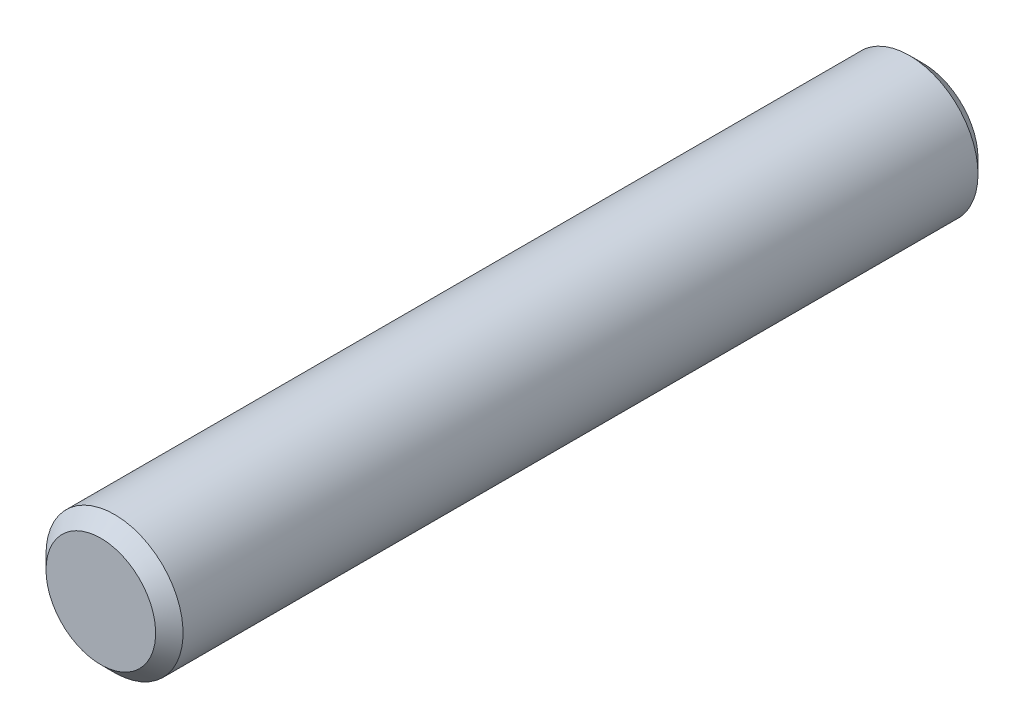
ISO-10303-21;
HEADER;
FILE_DESCRIPTION(('STEP AP214'),'2;1');
FILE_NAME('part.step','',(''),(''),'','','');
FILE_SCHEMA(('AUTOMOTIVE_DESIGN { 1 0 10303 214 1 1 1 1 }'));
ENDSEC;
DATA;
#1=APPLICATION_CONTEXT('core data for automotive mechanical design processes');
#2=APPLICATION_PROTOCOL_DEFINITION('international standard','automotive_design',2000,#1);
#3=PRODUCT_CONTEXT('',#1,'mechanical');
#4=PRODUCT('Part','Part','',(#3));
#5=PRODUCT_RELATED_PRODUCT_CATEGORY('part','',(#4));
#6=PRODUCT_DEFINITION_FORMATION('','',#4);
#7=PRODUCT_DEFINITION_CONTEXT('part definition',#1,'design');
#8=PRODUCT_DEFINITION('design','',#6,#7);
#9=PRODUCT_DEFINITION_SHAPE('','',#8);
#10=(LENGTH_UNIT() NAMED_UNIT(*) SI_UNIT(.MILLI.,.METRE.));
#11=(NAMED_UNIT(*) PLANE_ANGLE_UNIT() SI_UNIT($,.RADIAN.));
#12=(NAMED_UNIT(*) SI_UNIT($,.STERADIAN.) SOLID_ANGLE_UNIT());
#13=UNCERTAINTY_MEASURE_WITH_UNIT(LENGTH_MEASURE(1.E-05),#10,'distance_accuracy_value','');
#14=(GEOMETRIC_REPRESENTATION_CONTEXT(3) GLOBAL_UNCERTAINTY_ASSIGNED_CONTEXT((#13)) GLOBAL_UNIT_ASSIGNED_CONTEXT((#10,
#11,#12)) REPRESENTATION_CONTEXT('',''));
#15=CARTESIAN_POINT('',(0.,0.,0.));
#16=DIRECTION('',(0.,0.,1.));
#17=DIRECTION('',(1.,0.,0.));
#18=AXIS2_PLACEMENT_3D('',#15,#16,#17);
#19=CARTESIAN_POINT('',(0.,0.,19.05));
#20=DIRECTION('',(0.,0.,-1.));
#21=DIRECTION('',(-1.,0.,0.));
#22=AXIS2_PLACEMENT_3D('',#19,#20,#21);
#23=CYLINDRICAL_SURFACE('',#22,3.175);
#24=CARTESIAN_POINT('',(0.,0.,-18.415));
#25=DIRECTION('',(0.,0.,1.));
#26=DIRECTION('',(1.,0.,0.));
#27=AXIS2_PLACEMENT_3D('',#24,#25,#26);
#28=CIRCLE('',#27,3.175);
#29=CARTESIAN_POINT('',(-3.175,0.,-18.415));
#30=VERTEX_POINT('',#29);
#31=EDGE_CURVE('E49',#30,#30,#28,.T.);
#32=CARTESIAN_POINT('',(0.,0.,18.415));
#33=DIRECTION('',(0.,0.,1.));
#34=DIRECTION('',(1.,0.,0.));
#35=AXIS2_PLACEMENT_3D('',#32,#33,#34);
#36=CIRCLE('',#35,3.175);
#37=CARTESIAN_POINT('',(-3.175,0.,18.415));
#38=VERTEX_POINT('',#37);
#39=EDGE_CURVE('E54',#38,#38,#36,.F.);
#40=CARTESIAN_POINT('',(-3.175,0.,-18.415));
#41=CARTESIAN_POINT('',(-3.175,0.,-18.0313541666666));
#42=CARTESIAN_POINT('',(-3.175,0.,-17.6477083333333));
#43=CARTESIAN_POINT('',(-3.175,0.,-16.8804166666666));
#44=CARTESIAN_POINT('',(-3.175,0.,-16.4967708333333));
#45=CARTESIAN_POINT('',(-3.175,0.,-15.7294791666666));
#46=CARTESIAN_POINT('',(-3.175,0.,-15.3458333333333));
#47=CARTESIAN_POINT('',(-3.175,0.,-14.5785416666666));
#48=CARTESIAN_POINT('',(-3.175,0.,-14.1948958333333));
#49=CARTESIAN_POINT('',(-3.175,0.,-13.4276041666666));
#50=CARTESIAN_POINT('',(-3.175,0.,-13.0439583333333));
#51=CARTESIAN_POINT('',(-3.175,0.,-12.2766666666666));
#52=CARTESIAN_POINT('',(-3.175,0.,-11.8930208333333));
#53=CARTESIAN_POINT('',(-3.175,0.,-11.1257291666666));
#54=CARTESIAN_POINT('',(-3.175,0.,-10.7420833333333));
#55=CARTESIAN_POINT('',(-3.175,0.,-9.97479166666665));
#56=CARTESIAN_POINT('',(-3.175,0.,-9.59114583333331));
#57=CARTESIAN_POINT('',(-3.175,0.,-8.82385416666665));
#58=CARTESIAN_POINT('',(-3.175,0.,-8.44020833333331));
#59=CARTESIAN_POINT('',(-3.175,0.,-7.67291666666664));
#60=CARTESIAN_POINT('',(-3.175,0.,-7.28927083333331));
#61=CARTESIAN_POINT('',(-3.175,0.,-6.52197916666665));
#62=CARTESIAN_POINT('',(-3.175,0.,-6.13833333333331));
#63=CARTESIAN_POINT('',(-3.175,0.,-5.37104166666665));
#64=CARTESIAN_POINT('',(-3.175,0.,-4.98739583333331));
#65=CARTESIAN_POINT('',(-3.175,0.,-4.22010416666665));
#66=CARTESIAN_POINT('',(-3.175,0.,-3.83645833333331));
#67=CARTESIAN_POINT('',(-3.175,0.,-3.06916666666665));
#68=CARTESIAN_POINT('',(-3.175,0.,-2.68552083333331));
#69=CARTESIAN_POINT('',(-3.175,0.,-1.91822916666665));
#70=CARTESIAN_POINT('',(-3.175,0.,-1.53458333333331));
#71=CARTESIAN_POINT('',(-3.175,0.,-0.767291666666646));
#72=CARTESIAN_POINT('',(-3.175,0.,-0.383645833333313));
#73=CARTESIAN_POINT('',(-3.175,0.,0.383645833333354));
#74=CARTESIAN_POINT('',(-3.175,0.,0.767291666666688));
#75=CARTESIAN_POINT('',(-3.175,0.,1.53458333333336));
#76=CARTESIAN_POINT('',(-3.175,0.,1.91822916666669));
#77=CARTESIAN_POINT('',(-3.175,0.,2.68552083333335));
#78=CARTESIAN_POINT('',(-3.175,0.,3.06916666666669));
#79=CARTESIAN_POINT('',(-3.175,0.,3.83645833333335));
#80=CARTESIAN_POINT('',(-3.175,0.,4.22010416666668));
#81=CARTESIAN_POINT('',(-3.175,0.,4.98739583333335));
#82=CARTESIAN_POINT('',(-3.175,0.,5.37104166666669));
#83=CARTESIAN_POINT('',(-3.175,0.,6.13833333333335));
#84=CARTESIAN_POINT('',(-3.175,0.,6.52197916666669));
#85=CARTESIAN_POINT('',(-3.175,0.,7.28927083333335));
#86=CARTESIAN_POINT('',(-3.175,0.,7.67291666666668));
#87=CARTESIAN_POINT('',(-3.175,0.,8.44020833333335));
#88=CARTESIAN_POINT('',(-3.175,0.,8.82385416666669));
#89=CARTESIAN_POINT('',(-3.175,0.,9.59114583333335));
#90=CARTESIAN_POINT('',(-3.175,0.,9.97479166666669));
#91=CARTESIAN_POINT('',(-3.175,0.,10.7420833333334));
#92=CARTESIAN_POINT('',(-3.175,0.,11.1257291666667));
#93=CARTESIAN_POINT('',(-3.175,0.,11.8930208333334));
#94=CARTESIAN_POINT('',(-3.175,0.,12.2766666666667));
#95=CARTESIAN_POINT('',(-3.175,0.,13.0439583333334));
#96=CARTESIAN_POINT('',(-3.175,0.,13.4276041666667));
#97=CARTESIAN_POINT('',(-3.175,0.,14.1948958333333));
#98=CARTESIAN_POINT('',(-3.175,0.,14.5785416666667));
#99=CARTESIAN_POINT('',(-3.175,0.,15.3458333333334));
#100=CARTESIAN_POINT('',(-3.175,0.,15.7294791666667));
#101=CARTESIAN_POINT('',(-3.175,0.,16.4967708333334));
#102=CARTESIAN_POINT('',(-3.175,0.,16.8804166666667));
#103=CARTESIAN_POINT('',(-3.175,0.,17.6477083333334));
#104=CARTESIAN_POINT('',(-3.175,0.,18.0313541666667));
#105=CARTESIAN_POINT('',(-3.175,0.,18.415));
#106=B_SPLINE_CURVE_WITH_KNOTS('',3,(#40,#41,#42,#43,#44,#45,#46,#47,#48,#49,#50,#51,#52,#53,
#54,#55,#56,#57,#58,#59,#60,#61,#62,#63,#64,#65,#66,#67,#68,#69,#70,#71,#72,#73,#74,#75,#76,#77,
#78,#79,#80,#81,#82,#83,#84,#85,#86,#87,#88,#89,#90,#91,#92,#93,#94,#95,#96,#97,#98,#99,#100,
#101,#102,#103,#104,#105),.UNSPECIFIED.,.F.,.F.,(4,2,2,2,2,2,2,2,2,2,2,2,2,2,2,2,2,2,2,2,2,2,2,
2,2,2,2,2,2,2,2,2,4),(0.,1.1509375,2.301875,3.4528125,4.60375,5.7546875,6.905625,8.0565625,
9.2075,10.3584375,11.509375,12.6603125,13.81125,14.9621875,16.113125,17.2640625,18.415,
19.5659375,20.716875,21.8678125,23.01875,24.1696875,25.320625,26.4715625,27.6225,28.7734375,
29.924375,31.0753125,32.22625,33.3771875,34.528125,35.6790625,36.83),.UNSPECIFIED.);
#107=EDGE_CURVE('BSEAM36',#30,#38,#106,.T.);
#108=ORIENTED_EDGE('',*,*,#31,.T.);
#109=ORIENTED_EDGE('',*,*,#39,.T.);
#110=ORIENTED_EDGE('',*,*,#107,.T.);
#111=ORIENTED_EDGE('',*,*,#107,.F.);
#112=EDGE_LOOP('',(#108,#110,#109,#111));
#113=FACE_BOUND('',#112,.T.);
#114=ADVANCED_FACE('F36',(#113),#23,.T.);
#115=CARTESIAN_POINT('',(0.,0.,19.05));
#116=DIRECTION('',(0.,0.,1.));
#117=DIRECTION('',(1.,0.,0.));
#118=AXIS2_PLACEMENT_3D('',#115,#116,#117);
#119=PLANE('',#118);
#120=CARTESIAN_POINT('',(0.,0.,19.05));
#121=DIRECTION('',(0.,0.,1.));
#122=DIRECTION('',(1.,0.,0.));
#123=AXIS2_PLACEMENT_3D('',#120,#121,#122);
#124=CIRCLE('',#123,2.54000000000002);
#125=CARTESIAN_POINT('',(-2.54000000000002,0.,19.05));
#126=VERTEX_POINT('',#125);
#127=EDGE_CURVE('E10',#126,#126,#124,.T.);
#128=ORIENTED_EDGE('',*,*,#127,.T.);
#129=EDGE_LOOP('',(#128));
#130=FACE_BOUND('',#129,.T.);
#131=ADVANCED_FACE('F71',(#130),#119,.T.);
#132=CARTESIAN_POINT('',(0.,0.,-19.05));
#133=DIRECTION('',(0.,0.,1.));
#134=DIRECTION('',(1.,0.,0.));
#135=AXIS2_PLACEMENT_3D('',#132,#133,#134);
#136=PLANE('',#135);
#137=CARTESIAN_POINT('',(0.,0.,-19.05));
#138=DIRECTION('',(0.,0.,1.));
#139=DIRECTION('',(1.,0.,0.));
#140=AXIS2_PLACEMENT_3D('',#137,#138,#139);
#141=CIRCLE('',#140,2.53999999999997);
#142=CARTESIAN_POINT('',(2.53999999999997,0.,-19.05));
#143=VERTEX_POINT('',#142);
#144=EDGE_CURVE('E44',#143,#143,#141,.F.);
#145=ORIENTED_EDGE('',*,*,#144,.T.);
#146=EDGE_LOOP('',(#145));
#147=FACE_BOUND('',#146,.T.);
#148=ADVANCED_FACE('F68',(#147),#136,.F.);
#149=CARTESIAN_POINT('',(0.,0.,-18.415));
#150=DIRECTION('',(0.,0.,1.));
#151=DIRECTION('',(1.,0.,0.));
#152=AXIS2_PLACEMENT_3D('',#149,#150,#151);
#153=CONICAL_SURFACE('',#152,3.175,0.785398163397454);
#154=ORIENTED_EDGE('',*,*,#144,.F.);
#155=EDGE_LOOP('',(#154));
#156=FACE_BOUND('',#155,.T.);
#157=ORIENTED_EDGE('',*,*,#31,.F.);
#158=EDGE_LOOP('',(#157));
#159=FACE_BOUND('',#158,.T.);
#160=ADVANCED_FACE('F64',(#156,#159),#153,.T.);
#161=CARTESIAN_POINT('',(0.,0.,19.05));
#162=DIRECTION('',(0.,0.,-1.));
#163=DIRECTION('',(-1.,0.,0.));
#164=AXIS2_PLACEMENT_3D('',#161,#162,#163);
#165=CONICAL_SURFACE('',#164,2.54000000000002,0.785398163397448);
#166=CARTESIAN_POINT('',(-3.175,0.,18.415));
#167=CARTESIAN_POINT('',(-3.16838541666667,0.,18.4216145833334));
#168=CARTESIAN_POINT('',(-3.16177083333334,0.,18.4282291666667));
#169=CARTESIAN_POINT('',(-3.14854166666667,0.,18.4414583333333));
#170=CARTESIAN_POINT('',(-3.14192708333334,0.,18.4480729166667));
#171=CARTESIAN_POINT('',(-3.12869791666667,0.,18.4613020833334));
#172=CARTESIAN_POINT('',(-3.12208333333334,0.,18.4679166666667));
#173=CARTESIAN_POINT('',(-3.10885416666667,0.,18.4811458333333));
#174=CARTESIAN_POINT('',(-3.10223958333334,0.,18.4877604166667));
#175=CARTESIAN_POINT('',(-3.08901041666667,0.,18.5009895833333));
#176=CARTESIAN_POINT('',(-3.08239583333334,0.,18.5076041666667));
#177=CARTESIAN_POINT('',(-3.06916666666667,0.,18.5208333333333));
#178=CARTESIAN_POINT('',(-3.06255208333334,0.,18.5274479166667));
#179=CARTESIAN_POINT('',(-3.04932291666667,0.,18.5406770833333));
#180=CARTESIAN_POINT('',(-3.04270833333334,0.,18.5472916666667));
#181=CARTESIAN_POINT('',(-3.02947916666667,0.,18.5605208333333));
#182=CARTESIAN_POINT('',(-3.02286458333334,0.,18.5671354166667));
#183=CARTESIAN_POINT('',(-3.00963541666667,0.,18.5803645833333));
#184=CARTESIAN_POINT('',(-3.00302083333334,0.,18.5869791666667));
#185=CARTESIAN_POINT('',(-2.98979166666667,0.,18.6002083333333));
#186=CARTESIAN_POINT('',(-2.98317708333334,0.,18.6068229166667));
#187=CARTESIAN_POINT('',(-2.96994791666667,0.,18.6200520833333));
#188=CARTESIAN_POINT('',(-2.96333333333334,0.,18.6266666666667));
#189=CARTESIAN_POINT('',(-2.95010416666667,0.,18.6398958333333));
#190=CARTESIAN_POINT('',(-2.94348958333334,0.,18.6465104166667));
#191=CARTESIAN_POINT('',(-2.93026041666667,0.,18.6597395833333));
#192=CARTESIAN_POINT('',(-2.92364583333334,0.,18.6663541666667));
#193=CARTESIAN_POINT('',(-2.91041666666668,0.,18.6795833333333));
#194=CARTESIAN_POINT('',(-2.90380208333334,0.,18.6861979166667));
#195=CARTESIAN_POINT('',(-2.89057291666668,0.,18.6994270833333));
#196=CARTESIAN_POINT('',(-2.88395833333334,0.,18.7060416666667));
#197=CARTESIAN_POINT('',(-2.87072916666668,0.,18.7192708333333));
#198=CARTESIAN_POINT('',(-2.86411458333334,0.,18.7258854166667));
#199=CARTESIAN_POINT('',(-2.85088541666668,0.,18.7391145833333));
#200=CARTESIAN_POINT('',(-2.84427083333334,0.,18.7457291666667));
#201=CARTESIAN_POINT('',(-2.83104166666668,0.,18.7589583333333));
#202=CARTESIAN_POINT('',(-2.82442708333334,0.,18.7655729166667));
#203=CARTESIAN_POINT('',(-2.81119791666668,0.,18.7788020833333));
#204=CARTESIAN_POINT('',(-2.80458333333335,0.,18.7854166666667));
#205=CARTESIAN_POINT('',(-2.79135416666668,0.,18.7986458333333));
#206=CARTESIAN_POINT('',(-2.78473958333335,0.,18.8052604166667));
#207=CARTESIAN_POINT('',(-2.77151041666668,0.,18.8184895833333));
#208=CARTESIAN_POINT('',(-2.76489583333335,0.,18.8251041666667));
#209=CARTESIAN_POINT('',(-2.75166666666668,0.,18.8383333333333));
#210=CARTESIAN_POINT('',(-2.74505208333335,0.,18.8449479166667));
#211=CARTESIAN_POINT('',(-2.73182291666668,0.,18.8581770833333));
#212=CARTESIAN_POINT('',(-2.72520833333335,0.,18.8647916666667));
#213=CARTESIAN_POINT('',(-2.71197916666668,0.,18.8780208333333));
#214=CARTESIAN_POINT('',(-2.70536458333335,0.,18.8846354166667));
#215=CARTESIAN_POINT('',(-2.69213541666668,0.,18.8978645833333));
#216=CARTESIAN_POINT('',(-2.68552083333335,0.,18.9044791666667));
#217=CARTESIAN_POINT('',(-2.67229166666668,0.,18.9177083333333));
#218=CARTESIAN_POINT('',(-2.66567708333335,0.,18.9243229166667));
#219=CARTESIAN_POINT('',(-2.65244791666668,0.,18.9375520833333));
#220=CARTESIAN_POINT('',(-2.64583333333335,0.,18.9441666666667));
#221=CARTESIAN_POINT('',(-2.63260416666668,0.,18.9573958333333));
#222=CARTESIAN_POINT('',(-2.62598958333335,0.,18.9640104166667));
#223=CARTESIAN_POINT('',(-2.61276041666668,0.,18.9772395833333));
#224=CARTESIAN_POINT('',(-2.60614583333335,0.,18.9838541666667));
#225=CARTESIAN_POINT('',(-2.59291666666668,0.,18.9970833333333));
#226=CARTESIAN_POINT('',(-2.58630208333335,0.,19.0036979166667));
#227=CARTESIAN_POINT('',(-2.57307291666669,0.,19.0169270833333));
#228=CARTESIAN_POINT('',(-2.56645833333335,0.,19.0235416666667));
#229=CARTESIAN_POINT('',(-2.55322916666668,0.,19.0367708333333));
#230=CARTESIAN_POINT('',(-2.54661458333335,0.,19.0433854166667));
#231=CARTESIAN_POINT('',(-2.54000000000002,0.,19.05));
#232=B_SPLINE_CURVE_WITH_KNOTS('',3,(#166,#167,#168,#169,#170,#171,#172,#173,#174,#175,#176,
#177,#178,#179,#180,#181,#182,#183,#184,#185,#186,#187,#188,#189,#190,#191,#192,#193,#194,#195,
#196,#197,#198,#199,#200,#201,#202,#203,#204,#205,#206,#207,#208,#209,#210,#211,#212,#213,#214,
#215,#216,#217,#218,#219,#220,#221,#222,#223,#224,#225,#226,#227,#228,#229,#230,#231),
.UNSPECIFIED.,.F.,.F.,(4,2,2,2,2,2,2,2,2,2,2,2,2,2,2,2,2,2,2,2,2,2,2,2,2,2,2,2,2,2,2,2,4),(0.,
0.0280633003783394,0.0561266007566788,0.0841899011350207,0.11225320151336,0.1403165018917,
0.168379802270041,0.196443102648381,0.224506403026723,0.252569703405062,0.280633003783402,
0.308696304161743,0.336759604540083,0.364822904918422,0.392886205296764,0.420949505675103,
0.449012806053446,0.477076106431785,0.505139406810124,0.533202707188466,0.561266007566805,
0.589329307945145,0.617392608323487,0.645455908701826,0.673519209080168,0.701582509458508,
0.729645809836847,0.757709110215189,0.785772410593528,0.813835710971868,0.84189901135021,
0.869962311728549,0.898025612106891),.UNSPECIFIED.);
#233=EDGE_CURVE('BSEAM38',#38,#126,#232,.T.);
#234=ORIENTED_EDGE('',*,*,#39,.F.);
#235=ORIENTED_EDGE('',*,*,#127,.F.);
#236=ORIENTED_EDGE('',*,*,#233,.T.);
#237=ORIENTED_EDGE('',*,*,#233,.F.);
#238=EDGE_LOOP('',(#234,#236,#235,#237));
#239=FACE_BOUND('',#238,.T.);
#240=ADVANCED_FACE('F38',(#239),#165,.T.);
#241=CLOSED_SHELL('',(#114,#131,#148,#160,#240));
#242=MANIFOLD_SOLID_BREP('B2',#241);
#243=ADVANCED_BREP_SHAPE_REPRESENTATION('',(#18,#242),#14);
#244=SHAPE_DEFINITION_REPRESENTATION(#9,#243);
ENDSEC;
END-ISO-10303-21;
